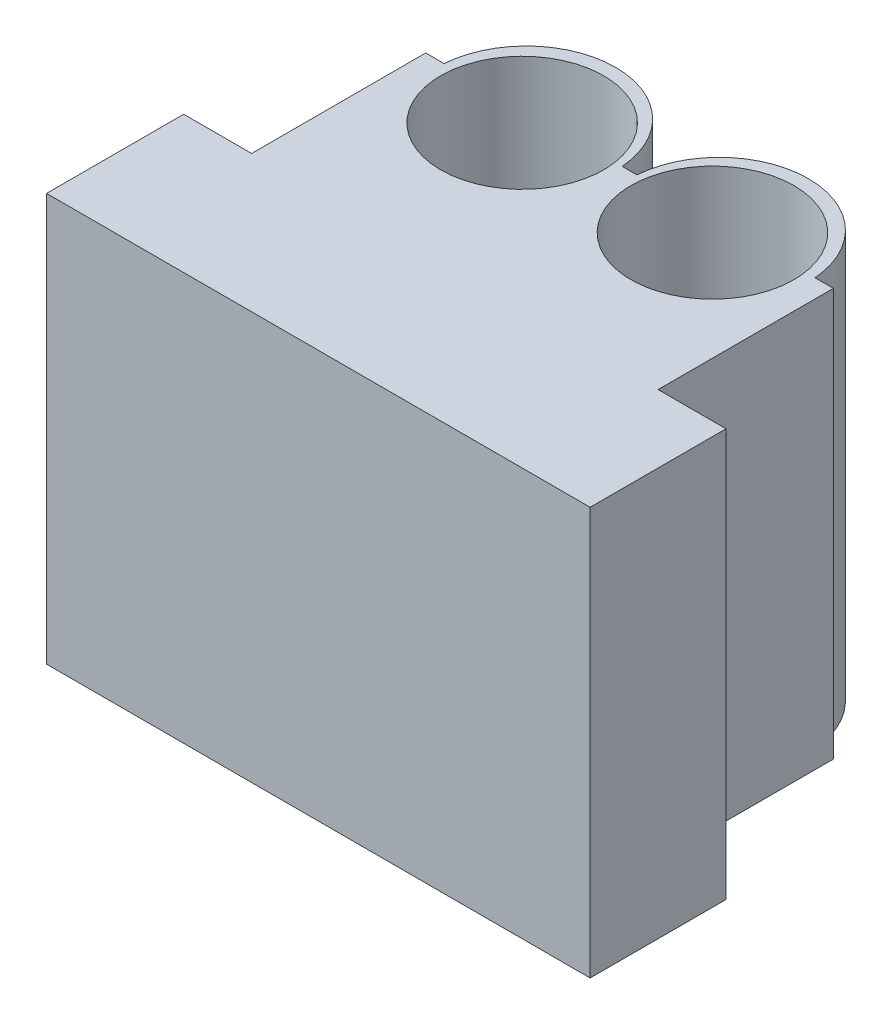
ISO-10303-21;
HEADER;
FILE_DESCRIPTION(('STEP AP214'),'2;1');
FILE_NAME('part.step','',(''),(''),'','','');
FILE_SCHEMA(('AUTOMOTIVE_DESIGN { 1 0 10303 214 1 1 1 1 }'));
ENDSEC;
DATA;
#1=APPLICATION_CONTEXT('core data for automotive mechanical design processes');
#2=APPLICATION_PROTOCOL_DEFINITION('international standard','automotive_design',2000,#1);
#3=PRODUCT_CONTEXT('',#1,'mechanical');
#4=PRODUCT('Part','Part','',(#3));
#5=PRODUCT_RELATED_PRODUCT_CATEGORY('part','',(#4));
#6=PRODUCT_DEFINITION_FORMATION('','',#4);
#7=PRODUCT_DEFINITION_CONTEXT('part definition',#1,'design');
#8=PRODUCT_DEFINITION('design','',#6,#7);
#9=PRODUCT_DEFINITION_SHAPE('','',#8);
#10=(LENGTH_UNIT() NAMED_UNIT(*) SI_UNIT(.MILLI.,.METRE.));
#11=(NAMED_UNIT(*) PLANE_ANGLE_UNIT() SI_UNIT($,.RADIAN.));
#12=(NAMED_UNIT(*) SI_UNIT($,.STERADIAN.) SOLID_ANGLE_UNIT());
#13=UNCERTAINTY_MEASURE_WITH_UNIT(LENGTH_MEASURE(1.E-05),#10,'distance_accuracy_value','');
#14=(GEOMETRIC_REPRESENTATION_CONTEXT(3) GLOBAL_UNCERTAINTY_ASSIGNED_CONTEXT((#13)) GLOBAL_UNIT_ASSIGNED_CONTEXT((#10,
#11,#12)) REPRESENTATION_CONTEXT('',''));
#15=CARTESIAN_POINT('',(0.,0.,0.));
#16=DIRECTION('',(0.,0.,1.));
#17=DIRECTION('',(1.,0.,0.));
#18=AXIS2_PLACEMENT_3D('',#15,#16,#17);
#19=CARTESIAN_POINT('',(15.,15.,15.));
#20=DIRECTION('',(-1.,0.,0.));
#21=DIRECTION('',(0.,-1.,0.));
#22=AXIS2_PLACEMENT_3D('',#19,#20,#21);
#23=PLANE('',#22);
#24=DIRECTION('',(0.,0.,-1.));
#25=VECTOR('',#24,1.);
#26=CARTESIAN_POINT('',(15.,-15.,15.));
#27=LINE('',#26,#25);
#28=CARTESIAN_POINT('',(15.,-15.,27.));
#29=VERTEX_POINT('',#28);
#30=CARTESIAN_POINT('',(15.,-15.,14.1));
#31=VERTEX_POINT('',#30);
#32=EDGE_CURVE('E263',#29,#31,#27,.T.);
#33=ORIENTED_EDGE('',*,*,#32,.T.);
#34=DIRECTION('',(0.,1.,0.));
#35=VECTOR('',#34,1.);
#36=CARTESIAN_POINT('',(15.,-15.,14.1));
#37=LINE('',#36,#35);
#38=CARTESIAN_POINT('',(15.,15.,14.1));
#39=VERTEX_POINT('',#38);
#40=EDGE_CURVE('E62',#31,#39,#37,.T.);
#41=ORIENTED_EDGE('',*,*,#40,.T.);
#42=DIRECTION('',(0.,0.,-1.));
#43=VECTOR('',#42,1.);
#44=CARTESIAN_POINT('',(15.,15.,15.));
#45=LINE('',#44,#43);
#46=CARTESIAN_POINT('',(15.,15.,27.));
#47=VERTEX_POINT('',#46);
#48=EDGE_CURVE('E11',#47,#39,#45,.T.);
#49=ORIENTED_EDGE('',*,*,#48,.F.);
#50=DIRECTION('',(0.,1.,0.));
#51=VECTOR('',#50,1.);
#52=CARTESIAN_POINT('',(15.,-15.,27.));
#53=LINE('',#52,#51);
#54=EDGE_CURVE('E187',#29,#47,#53,.T.);
#55=ORIENTED_EDGE('',*,*,#54,.F.);
#56=EDGE_LOOP('',(#33,#41,#49,#55));
#57=FACE_BOUND('',#56,.T.);
#58=ADVANCED_FACE('F39',(#57),#23,.F.);
#59=CARTESIAN_POINT('',(-15.,15.,15.));
#60=DIRECTION('',(0.,-1.,0.));
#61=DIRECTION('',(0.,0.,-1.));
#62=AXIS2_PLACEMENT_3D('',#59,#60,#61);
#63=PLANE('',#62);
#64=CARTESIAN_POINT('',(-7.,15.,15.));
#65=DIRECTION('',(0.,1.,0.));
#66=DIRECTION('',(0.,0.,1.));
#67=AXIS2_PLACEMENT_3D('',#64,#65,#66);
#68=CIRCLE('',#67,6.);
#69=CARTESIAN_POINT('',(-7.,15.,21.));
#70=VERTEX_POINT('',#69);
#71=EDGE_CURVE('E254',#70,#70,#68,.T.);
#72=ORIENTED_EDGE('',*,*,#71,.F.);
#73=EDGE_LOOP('',(#72));
#74=FACE_BOUND('',#73,.T.);
#75=CARTESIAN_POINT('',(7.,15.,15.));
#76=DIRECTION('',(0.,1.,0.));
#77=DIRECTION('',(0.,0.,-1.));
#78=AXIS2_PLACEMENT_3D('',#75,#76,#77);
#79=CIRCLE('',#78,6.);
#80=CARTESIAN_POINT('',(7.,15.,9.));
#81=VERTEX_POINT('',#80);
#82=EDGE_CURVE('E239',#81,#81,#79,.T.);
#83=ORIENTED_EDGE('',*,*,#82,.F.);
#84=EDGE_LOOP('',(#83));
#85=FACE_BOUND('',#84,.T.);
#86=ORIENTED_EDGE('',*,*,#48,.T.);
#87=DIRECTION('',(1.,0.,0.));
#88=VECTOR('',#87,1.);
#89=CARTESIAN_POINT('',(15.,15.,14.1));
#90=LINE('',#89,#88);
#91=CARTESIAN_POINT('',(13.6469380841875,15.,14.1));
#92=VERTEX_POINT('',#91);
#93=EDGE_CURVE('E216',#92,#39,#90,.T.);
#94=ORIENTED_EDGE('',*,*,#93,.F.);
#95=CARTESIAN_POINT('',(7.09360025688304,15.,14.599082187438));
#96=DIRECTION('',(0.,-1.,0.));
#97=DIRECTION('',(0.,0.,1.));
#98=AXIS2_PLACEMENT_3D('',#95,#96,#97);
#99=CIRCLE('',#98,6.57231463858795);
#100=CARTESIAN_POINT('',(0.540262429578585,15.,14.1));
#101=VERTEX_POINT('',#100);
#102=EDGE_CURVE('E212',#101,#92,#99,.T.);
#103=ORIENTED_EDGE('',*,*,#102,.F.);
#104=DIRECTION('',(1.,0.,0.));
#105=VECTOR('',#104,1.);
#106=CARTESIAN_POINT('',(-0.540262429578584,15.,14.1));
#107=LINE('',#106,#105);
#108=CARTESIAN_POINT('',(-0.540262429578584,15.,14.1));
#109=VERTEX_POINT('',#108);
#110=EDGE_CURVE('E208',#109,#101,#107,.T.);
#111=ORIENTED_EDGE('',*,*,#110,.F.);
#112=CARTESIAN_POINT('',(-7.09360025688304,15.,14.599082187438));
#113=DIRECTION('',(0.,-1.,0.));
#114=DIRECTION('',(0.,0.,-1.));
#115=AXIS2_PLACEMENT_3D('',#112,#113,#114);
#116=CIRCLE('',#115,6.57231463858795);
#117=CARTESIAN_POINT('',(-13.6469380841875,15.,14.1));
#118=VERTEX_POINT('',#117);
#119=EDGE_CURVE('E204',#118,#109,#116,.T.);
#120=ORIENTED_EDGE('',*,*,#119,.F.);
#121=DIRECTION('',(1.,0.,0.));
#122=VECTOR('',#121,1.);
#123=CARTESIAN_POINT('',(-15.,15.,14.1));
#124=LINE('',#123,#122);
#125=CARTESIAN_POINT('',(-15.,15.,14.1));
#126=VERTEX_POINT('',#125);
#127=EDGE_CURVE('E191',#126,#118,#124,.T.);
#128=ORIENTED_EDGE('',*,*,#127,.F.);
#129=DIRECTION('',(0.,0.,-1.));
#130=VECTOR('',#129,1.);
#131=CARTESIAN_POINT('',(-15.,15.,15.));
#132=LINE('',#131,#130);
#133=CARTESIAN_POINT('',(-15.,15.,26.9097715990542));
#134=VERTEX_POINT('',#133);
#135=EDGE_CURVE('E47',#134,#126,#132,.T.);
#136=ORIENTED_EDGE('',*,*,#135,.F.);
#137=DIRECTION('',(-1.,0.,0.));
#138=VECTOR('',#137,1.);
#139=CARTESIAN_POINT('',(-20.,15.,26.9097715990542));
#140=LINE('',#139,#138);
#141=CARTESIAN_POINT('',(-20.,15.,26.9097715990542));
#142=VERTEX_POINT('',#141);
#143=EDGE_CURVE('E137',#134,#142,#140,.T.);
#144=ORIENTED_EDGE('',*,*,#143,.T.);
#145=DIRECTION('',(0.,0.,1.));
#146=VECTOR('',#145,1.);
#147=CARTESIAN_POINT('',(-20.,15.,29.));
#148=LINE('',#147,#146);
#149=CARTESIAN_POINT('',(-20.,15.,37.));
#150=VERTEX_POINT('',#149);
#151=EDGE_CURVE('E130',#142,#150,#148,.T.);
#152=ORIENTED_EDGE('',*,*,#151,.T.);
#153=DIRECTION('',(1.,0.,0.));
#154=VECTOR('',#153,1.);
#155=CARTESIAN_POINT('',(20.,15.,37.));
#156=LINE('',#155,#154);
#157=CARTESIAN_POINT('',(20.,15.,37.));
#158=VERTEX_POINT('',#157);
#159=EDGE_CURVE('E135',#150,#158,#156,.T.);
#160=ORIENTED_EDGE('',*,*,#159,.T.);
#161=DIRECTION('',(0.,0.,-1.));
#162=VECTOR('',#161,1.);
#163=CARTESIAN_POINT('',(20.,15.,29.));
#164=LINE('',#163,#162);
#165=CARTESIAN_POINT('',(20.,15.,27.));
#166=VERTEX_POINT('',#165);
#167=EDGE_CURVE('E140',#158,#166,#164,.T.);
#168=ORIENTED_EDGE('',*,*,#167,.T.);
#169=DIRECTION('',(-1.,0.,0.));
#170=VECTOR('',#169,1.);
#171=CARTESIAN_POINT('',(20.,15.,27.));
#172=LINE('',#171,#170);
#173=EDGE_CURVE('E168',#166,#47,#172,.T.);
#174=ORIENTED_EDGE('',*,*,#173,.T.);
#175=EDGE_LOOP('',(#86,#94,#103,#111,#120,#128,#136,#144,#152,#160,#168,#174));
#176=FACE_BOUND('',#175,.T.);
#177=ADVANCED_FACE('F132',(#74,#85,#176),#63,.F.);
#178=CARTESIAN_POINT('',(-15.,15.,15.));
#179=DIRECTION('',(1.,0.,0.));
#180=DIRECTION('',(0.,1.,0.));
#181=AXIS2_PLACEMENT_3D('',#178,#179,#180);
#182=PLANE('',#181);
#183=ORIENTED_EDGE('',*,*,#135,.T.);
#184=DIRECTION('',(0.,1.,0.));
#185=VECTOR('',#184,1.);
#186=CARTESIAN_POINT('',(-15.,-15.,14.1));
#187=LINE('',#186,#185);
#188=CARTESIAN_POINT('',(-15.,-15.,14.1));
#189=VERTEX_POINT('',#188);
#190=EDGE_CURVE('E236',#189,#126,#187,.T.);
#191=ORIENTED_EDGE('',*,*,#190,.F.);
#192=DIRECTION('',(0.,0.,-1.));
#193=VECTOR('',#192,1.);
#194=CARTESIAN_POINT('',(-15.,-15.,15.));
#195=LINE('',#194,#193);
#196=CARTESIAN_POINT('',(-15.,-15.,26.9097715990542));
#197=VERTEX_POINT('',#196);
#198=EDGE_CURVE('E273',#197,#189,#195,.T.);
#199=ORIENTED_EDGE('',*,*,#198,.F.);
#200=DIRECTION('',(0.,1.,0.));
#201=VECTOR('',#200,1.);
#202=CARTESIAN_POINT('',(-15.,-15.,26.9097715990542));
#203=LINE('',#202,#201);
#204=EDGE_CURVE('E186',#197,#134,#203,.T.);
#205=ORIENTED_EDGE('',*,*,#204,.T.);
#206=EDGE_LOOP('',(#183,#191,#199,#205));
#207=FACE_BOUND('',#206,.T.);
#208=ADVANCED_FACE('F280',(#207),#182,.F.);
#209=CARTESIAN_POINT('',(-15.,-15.,15.));
#210=DIRECTION('',(0.,1.,0.));
#211=DIRECTION('',(0.,0.,1.));
#212=AXIS2_PLACEMENT_3D('',#209,#210,#211);
#213=PLANE('',#212);
#214=CARTESIAN_POINT('',(7.,-15.,15.));
#215=DIRECTION('',(0.,1.,0.));
#216=DIRECTION('',(0.,0.,-1.));
#217=AXIS2_PLACEMENT_3D('',#214,#215,#216);
#218=CIRCLE('',#217,6.);
#219=CARTESIAN_POINT('',(7.,-15.,9.));
#220=VERTEX_POINT('',#219);
#221=EDGE_CURVE('E259',#220,#220,#218,.T.);
#222=ORIENTED_EDGE('',*,*,#221,.T.);
#223=EDGE_LOOP('',(#222));
#224=FACE_BOUND('',#223,.T.);
#225=ORIENTED_EDGE('',*,*,#32,.F.);
#226=DIRECTION('',(-1.,0.,0.));
#227=VECTOR('',#226,1.);
#228=CARTESIAN_POINT('',(20.,-15.,27.));
#229=LINE('',#228,#227);
#230=CARTESIAN_POINT('',(20.,-15.,27.));
#231=VERTEX_POINT('',#230);
#232=EDGE_CURVE('E182',#231,#29,#229,.T.);
#233=ORIENTED_EDGE('',*,*,#232,.F.);
#234=DIRECTION('',(0.,0.,-1.));
#235=VECTOR('',#234,1.);
#236=CARTESIAN_POINT('',(20.,-15.,29.));
#237=LINE('',#236,#235);
#238=CARTESIAN_POINT('',(20.,-15.,37.));
#239=VERTEX_POINT('',#238);
#240=EDGE_CURVE('E178',#239,#231,#237,.T.);
#241=ORIENTED_EDGE('',*,*,#240,.F.);
#242=DIRECTION('',(1.,0.,0.));
#243=VECTOR('',#242,1.);
#244=CARTESIAN_POINT('',(20.,-15.,37.));
#245=LINE('',#244,#243);
#246=CARTESIAN_POINT('',(-20.,-15.,37.));
#247=VERTEX_POINT('',#246);
#248=EDGE_CURVE('E152',#247,#239,#245,.T.);
#249=ORIENTED_EDGE('',*,*,#248,.F.);
#250=DIRECTION('',(0.,0.,1.));
#251=VECTOR('',#250,1.);
#252=CARTESIAN_POINT('',(-20.,-15.,29.));
#253=LINE('',#252,#251);
#254=CARTESIAN_POINT('',(-20.,-15.,26.9097715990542));
#255=VERTEX_POINT('',#254);
#256=EDGE_CURVE('E146',#255,#247,#253,.T.);
#257=ORIENTED_EDGE('',*,*,#256,.F.);
#258=DIRECTION('',(-1.,0.,0.));
#259=VECTOR('',#258,1.);
#260=CARTESIAN_POINT('',(-20.,-15.,26.9097715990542));
#261=LINE('',#260,#259);
#262=EDGE_CURVE('E172',#197,#255,#261,.T.);
#263=ORIENTED_EDGE('',*,*,#262,.F.);
#264=ORIENTED_EDGE('',*,*,#198,.T.);
#265=DIRECTION('',(1.,0.,0.));
#266=VECTOR('',#265,1.);
#267=CARTESIAN_POINT('',(-15.,-15.,14.1));
#268=LINE('',#267,#266);
#269=CARTESIAN_POINT('',(-13.6469380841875,-15.,14.1));
#270=VERTEX_POINT('',#269);
#271=EDGE_CURVE('E219',#189,#270,#268,.T.);
#272=ORIENTED_EDGE('',*,*,#271,.T.);
#273=CARTESIAN_POINT('',(-7.09360025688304,-15.,14.599082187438));
#274=DIRECTION('',(0.,-1.,0.));
#275=DIRECTION('',(0.,0.,-1.));
#276=AXIS2_PLACEMENT_3D('',#273,#274,#275);
#277=CIRCLE('',#276,6.57231463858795);
#278=CARTESIAN_POINT('',(-0.540262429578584,-15.,14.1));
#279=VERTEX_POINT('',#278);
#280=EDGE_CURVE('E54',#270,#279,#277,.T.);
#281=ORIENTED_EDGE('',*,*,#280,.T.);
#282=DIRECTION('',(1.,0.,0.));
#283=VECTOR('',#282,1.);
#284=CARTESIAN_POINT('',(-0.540262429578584,-15.,14.1));
#285=LINE('',#284,#283);
#286=CARTESIAN_POINT('',(0.540262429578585,-15.,14.1));
#287=VERTEX_POINT('',#286);
#288=EDGE_CURVE('E225',#279,#287,#285,.T.);
#289=ORIENTED_EDGE('',*,*,#288,.T.);
#290=CARTESIAN_POINT('',(7.09360025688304,-15.,14.599082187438));
#291=DIRECTION('',(0.,-1.,0.));
#292=DIRECTION('',(0.,0.,1.));
#293=AXIS2_PLACEMENT_3D('',#290,#291,#292);
#294=CIRCLE('',#293,6.57231463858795);
#295=CARTESIAN_POINT('',(13.6469380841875,-15.,14.1));
#296=VERTEX_POINT('',#295);
#297=EDGE_CURVE('E229',#287,#296,#294,.T.);
#298=ORIENTED_EDGE('',*,*,#297,.T.);
#299=DIRECTION('',(1.,0.,0.));
#300=VECTOR('',#299,1.);
#301=CARTESIAN_POINT('',(15.,-15.,14.1));
#302=LINE('',#301,#300);
#303=EDGE_CURVE('E233',#296,#31,#302,.T.);
#304=ORIENTED_EDGE('',*,*,#303,.T.);
#305=EDGE_LOOP('',(#225,#233,#241,#249,#257,#263,#264,#272,#281,#289,#298,#304));
#306=FACE_BOUND('',#305,.T.);
#307=CARTESIAN_POINT('',(-7.,-15.,15.));
#308=DIRECTION('',(0.,1.,0.));
#309=DIRECTION('',(0.,0.,1.));
#310=AXIS2_PLACEMENT_3D('',#307,#308,#309);
#311=CIRCLE('',#310,6.);
#312=CARTESIAN_POINT('',(-7.,-15.,21.));
#313=VERTEX_POINT('',#312);
#314=EDGE_CURVE('E258',#313,#313,#311,.T.);
#315=ORIENTED_EDGE('',*,*,#314,.T.);
#316=EDGE_LOOP('',(#315));
#317=FACE_BOUND('',#316,.T.);
#318=ADVANCED_FACE('F288',(#224,#306,#317),#213,.F.);
#319=CARTESIAN_POINT('',(7.,-15.,15.));
#320=DIRECTION('',(0.,1.,0.));
#321=DIRECTION('',(0.,0.,1.));
#322=AXIS2_PLACEMENT_3D('',#319,#320,#321);
#323=CYLINDRICAL_SURFACE('',#322,6.);
#324=ORIENTED_EDGE('',*,*,#82,.T.);
#325=EDGE_LOOP('',(#324));
#326=FACE_BOUND('',#325,.T.);
#327=ORIENTED_EDGE('',*,*,#221,.F.);
#328=EDGE_LOOP('',(#327));
#329=FACE_BOUND('',#328,.T.);
#330=ADVANCED_FACE('F334',(#326,#329),#323,.F.);
#331=CARTESIAN_POINT('',(-7.,-15.,15.));
#332=DIRECTION('',(0.,1.,0.));
#333=DIRECTION('',(0.,0.,1.));
#334=AXIS2_PLACEMENT_3D('',#331,#332,#333);
#335=CYLINDRICAL_SURFACE('',#334,6.);
#336=ORIENTED_EDGE('',*,*,#71,.T.);
#337=EDGE_LOOP('',(#336));
#338=FACE_BOUND('',#337,.T.);
#339=ORIENTED_EDGE('',*,*,#314,.F.);
#340=EDGE_LOOP('',(#339));
#341=FACE_BOUND('',#340,.T.);
#342=ADVANCED_FACE('F338',(#338,#341),#335,.F.);
#343=CARTESIAN_POINT('',(15.,-15.,14.1));
#344=DIRECTION('',(0.,0.,1.));
#345=DIRECTION('',(1.,0.,0.));
#346=AXIS2_PLACEMENT_3D('',#343,#344,#345);
#347=PLANE('',#346);
#348=ORIENTED_EDGE('',*,*,#40,.F.);
#349=ORIENTED_EDGE('',*,*,#303,.F.);
#350=DIRECTION('',(0.,1.,0.));
#351=VECTOR('',#350,1.);
#352=CARTESIAN_POINT('',(13.6469380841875,-15.,14.1));
#353=LINE('',#352,#351);
#354=EDGE_CURVE('E240',#296,#92,#353,.T.);
#355=ORIENTED_EDGE('',*,*,#354,.T.);
#356=ORIENTED_EDGE('',*,*,#93,.T.);
#357=EDGE_LOOP('',(#348,#349,#355,#356));
#358=FACE_BOUND('',#357,.T.);
#359=ADVANCED_FACE('F303',(#358),#347,.F.);
#360=CARTESIAN_POINT('',(7.09360025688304,-15.,14.599082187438));
#361=DIRECTION('',(0.,1.,0.));
#362=DIRECTION('',(0.,0.,1.));
#363=AXIS2_PLACEMENT_3D('',#360,#361,#362);
#364=CYLINDRICAL_SURFACE('',#363,6.57231463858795);
#365=ORIENTED_EDGE('',*,*,#354,.F.);
#366=ORIENTED_EDGE('',*,*,#297,.F.);
#367=DIRECTION('',(0.,1.,0.));
#368=VECTOR('',#367,1.);
#369=CARTESIAN_POINT('',(0.540262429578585,-15.,14.1));
#370=LINE('',#369,#368);
#371=EDGE_CURVE('E243',#287,#101,#370,.T.);
#372=ORIENTED_EDGE('',*,*,#371,.T.);
#373=ORIENTED_EDGE('',*,*,#102,.T.);
#374=EDGE_LOOP('',(#365,#366,#372,#373));
#375=FACE_BOUND('',#374,.T.);
#376=ADVANCED_FACE('F306',(#375),#364,.T.);
#377=CARTESIAN_POINT('',(-0.540262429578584,-15.,14.1));
#378=DIRECTION('',(0.,0.,1.));
#379=DIRECTION('',(1.,0.,0.));
#380=AXIS2_PLACEMENT_3D('',#377,#378,#379);
#381=PLANE('',#380);
#382=ORIENTED_EDGE('',*,*,#371,.F.);
#383=ORIENTED_EDGE('',*,*,#288,.F.);
#384=DIRECTION('',(0.,1.,0.));
#385=VECTOR('',#384,1.);
#386=CARTESIAN_POINT('',(-0.540262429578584,-15.,14.1));
#387=LINE('',#386,#385);
#388=EDGE_CURVE('E246',#279,#109,#387,.T.);
#389=ORIENTED_EDGE('',*,*,#388,.T.);
#390=ORIENTED_EDGE('',*,*,#110,.T.);
#391=EDGE_LOOP('',(#382,#383,#389,#390));
#392=FACE_BOUND('',#391,.T.);
#393=ADVANCED_FACE('F309',(#392),#381,.F.);
#394=CARTESIAN_POINT('',(-7.09360025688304,-15.,14.599082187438));
#395=DIRECTION('',(0.,1.,0.));
#396=DIRECTION('',(0.,0.,1.));
#397=AXIS2_PLACEMENT_3D('',#394,#395,#396);
#398=CYLINDRICAL_SURFACE('',#397,6.57231463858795);
#399=ORIENTED_EDGE('',*,*,#388,.F.);
#400=ORIENTED_EDGE('',*,*,#280,.F.);
#401=DIRECTION('',(0.,1.,0.));
#402=VECTOR('',#401,1.);
#403=CARTESIAN_POINT('',(-13.6469380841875,-15.,14.1));
#404=LINE('',#403,#402);
#405=EDGE_CURVE('E249',#270,#118,#404,.T.);
#406=ORIENTED_EDGE('',*,*,#405,.T.);
#407=ORIENTED_EDGE('',*,*,#119,.T.);
#408=EDGE_LOOP('',(#399,#400,#406,#407));
#409=FACE_BOUND('',#408,.T.);
#410=ADVANCED_FACE('F310',(#409),#398,.T.);
#411=CARTESIAN_POINT('',(-15.,-15.,14.1));
#412=DIRECTION('',(0.,0.,1.));
#413=DIRECTION('',(1.,0.,0.));
#414=AXIS2_PLACEMENT_3D('',#411,#412,#413);
#415=PLANE('',#414);
#416=ORIENTED_EDGE('',*,*,#405,.F.);
#417=ORIENTED_EDGE('',*,*,#271,.F.);
#418=ORIENTED_EDGE('',*,*,#190,.T.);
#419=ORIENTED_EDGE('',*,*,#127,.T.);
#420=EDGE_LOOP('',(#416,#417,#418,#419));
#421=FACE_BOUND('',#420,.T.);
#422=ADVANCED_FACE('F286',(#421),#415,.F.);
#423=CARTESIAN_POINT('',(20.,-15.,27.));
#424=DIRECTION('',(0.,0.,-1.));
#425=DIRECTION('',(-1.,0.,0.));
#426=AXIS2_PLACEMENT_3D('',#423,#424,#425);
#427=PLANE('',#426);
#428=ORIENTED_EDGE('',*,*,#54,.T.);
#429=ORIENTED_EDGE('',*,*,#173,.F.);
#430=DIRECTION('',(0.,1.,0.));
#431=VECTOR('',#430,1.);
#432=CARTESIAN_POINT('',(20.,-15.,27.));
#433=LINE('',#432,#431);
#434=EDGE_CURVE('E192',#231,#166,#433,.T.);
#435=ORIENTED_EDGE('',*,*,#434,.F.);
#436=ORIENTED_EDGE('',*,*,#232,.T.);
#437=EDGE_LOOP('',(#428,#429,#435,#436));
#438=FACE_BOUND('',#437,.T.);
#439=ADVANCED_FACE('F298',(#438),#427,.T.);
#440=CARTESIAN_POINT('',(20.,-15.,29.));
#441=DIRECTION('',(1.,0.,0.));
#442=DIRECTION('',(0.,0.,-1.));
#443=AXIS2_PLACEMENT_3D('',#440,#441,#442);
#444=PLANE('',#443);
#445=ORIENTED_EDGE('',*,*,#434,.T.);
#446=ORIENTED_EDGE('',*,*,#167,.F.);
#447=DIRECTION('',(0.,1.,0.));
#448=VECTOR('',#447,1.);
#449=CARTESIAN_POINT('',(20.,-15.,37.));
#450=LINE('',#449,#448);
#451=EDGE_CURVE('E151',#239,#158,#450,.T.);
#452=ORIENTED_EDGE('',*,*,#451,.F.);
#453=ORIENTED_EDGE('',*,*,#240,.T.);
#454=EDGE_LOOP('',(#445,#446,#452,#453));
#455=FACE_BOUND('',#454,.T.);
#456=ADVANCED_FACE('F295',(#455),#444,.T.);
#457=CARTESIAN_POINT('',(-20.,-15.,29.));
#458=DIRECTION('',(-1.,0.,0.));
#459=DIRECTION('',(0.,0.,1.));
#460=AXIS2_PLACEMENT_3D('',#457,#458,#459);
#461=PLANE('',#460);
#462=ORIENTED_EDGE('',*,*,#256,.T.);
#463=DIRECTION('',(0.,1.,0.));
#464=VECTOR('',#463,1.);
#465=CARTESIAN_POINT('',(-20.,-15.,37.));
#466=LINE('',#465,#464);
#467=EDGE_CURVE('E143',#247,#150,#466,.T.);
#468=ORIENTED_EDGE('',*,*,#467,.T.);
#469=ORIENTED_EDGE('',*,*,#151,.F.);
#470=DIRECTION('',(0.,1.,0.));
#471=VECTOR('',#470,1.);
#472=CARTESIAN_POINT('',(-20.,-15.,26.9097715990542));
#473=LINE('',#472,#471);
#474=EDGE_CURVE('E195',#255,#142,#473,.T.);
#475=ORIENTED_EDGE('',*,*,#474,.F.);
#476=EDGE_LOOP('',(#462,#468,#469,#475));
#477=FACE_BOUND('',#476,.T.);
#478=ADVANCED_FACE('F144',(#477),#461,.T.);
#479=CARTESIAN_POINT('',(-20.,-15.,26.9097715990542));
#480=DIRECTION('',(0.,0.,-1.));
#481=DIRECTION('',(-1.,0.,0.));
#482=AXIS2_PLACEMENT_3D('',#479,#480,#481);
#483=PLANE('',#482);
#484=ORIENTED_EDGE('',*,*,#474,.T.);
#485=ORIENTED_EDGE('',*,*,#143,.F.);
#486=ORIENTED_EDGE('',*,*,#204,.F.);
#487=ORIENTED_EDGE('',*,*,#262,.T.);
#488=EDGE_LOOP('',(#484,#485,#486,#487));
#489=FACE_BOUND('',#488,.T.);
#490=ADVANCED_FACE('F292',(#489),#483,.T.);
#491=CARTESIAN_POINT('',(20.,-15.,37.));
#492=DIRECTION('',(0.,0.,1.));
#493=DIRECTION('',(1.,0.,0.));
#494=AXIS2_PLACEMENT_3D('',#491,#492,#493);
#495=PLANE('',#494);
#496=ORIENTED_EDGE('',*,*,#451,.T.);
#497=ORIENTED_EDGE('',*,*,#159,.F.);
#498=ORIENTED_EDGE('',*,*,#467,.F.);
#499=ORIENTED_EDGE('',*,*,#248,.T.);
#500=EDGE_LOOP('',(#496,#497,#498,#499));
#501=FACE_BOUND('',#500,.T.);
#502=ADVANCED_FACE('F155',(#501),#495,.T.);
#503=CLOSED_SHELL('',(#58,#177,#208,#318,#330,#342,#359,#376,#393,#410,#422,#439,#456,#478,#490,#502));
#504=MANIFOLD_SOLID_BREP('B2',#503);
#505=ADVANCED_BREP_SHAPE_REPRESENTATION('',(#18,#504),#14);
#506=SHAPE_DEFINITION_REPRESENTATION(#9,#505);
ENDSEC;
END-ISO-10303-21;
